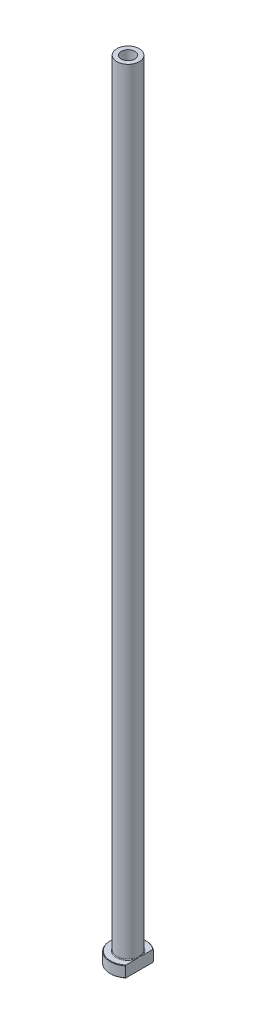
ISO-10303-21;
HEADER;
FILE_DESCRIPTION(('STEP AP214'),'2;1');
FILE_NAME('part.step','',(''),(''),'','','');
FILE_SCHEMA(('AUTOMOTIVE_DESIGN { 1 0 10303 214 1 1 1 1 }'));
ENDSEC;
DATA;
#1=APPLICATION_CONTEXT('core data for automotive mechanical design processes');
#2=APPLICATION_PROTOCOL_DEFINITION('international standard','automotive_design',2000,#1);
#3=PRODUCT_CONTEXT('',#1,'mechanical');
#4=PRODUCT('Part','Part','',(#3));
#5=PRODUCT_RELATED_PRODUCT_CATEGORY('part','',(#4));
#6=PRODUCT_DEFINITION_FORMATION('','',#4);
#7=PRODUCT_DEFINITION_CONTEXT('part definition',#1,'design');
#8=PRODUCT_DEFINITION('design','',#6,#7);
#9=PRODUCT_DEFINITION_SHAPE('','',#8);
#10=(LENGTH_UNIT() NAMED_UNIT(*) SI_UNIT(.MILLI.,.METRE.));
#11=(NAMED_UNIT(*) PLANE_ANGLE_UNIT() SI_UNIT($,.RADIAN.));
#12=(NAMED_UNIT(*) SI_UNIT($,.STERADIAN.) SOLID_ANGLE_UNIT());
#13=UNCERTAINTY_MEASURE_WITH_UNIT(LENGTH_MEASURE(1.E-05),#10,'distance_accuracy_value','');
#14=(GEOMETRIC_REPRESENTATION_CONTEXT(3) GLOBAL_UNCERTAINTY_ASSIGNED_CONTEXT((#13)) GLOBAL_UNIT_ASSIGNED_CONTEXT((#10,
#11,#12)) REPRESENTATION_CONTEXT('',''));
#15=CARTESIAN_POINT('',(0.,0.,0.));
#16=DIRECTION('',(0.,0.,1.));
#17=DIRECTION('',(1.,0.,0.));
#18=AXIS2_PLACEMENT_3D('',#15,#16,#17);
#19=CARTESIAN_POINT('',(0.,92.1876809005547,0.));
#20=DIRECTION('',(0.,1.,0.));
#21=DIRECTION('',(0.,0.,1.));
#22=AXIS2_PLACEMENT_3D('',#19,#20,#21);
#23=CYLINDRICAL_SURFACE('',#22,3.00000000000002);
#24=CARTESIAN_POINT('',(0.,350.,0.));
#25=DIRECTION('',(0.,1.,0.));
#26=DIRECTION('',(0.,0.,1.));
#27=AXIS2_PLACEMENT_3D('',#24,#25,#26);
#28=CIRCLE('',#27,3.00000000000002);
#29=CARTESIAN_POINT('',(0.,350.,3.00000000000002));
#30=VERTEX_POINT('',#29);
#31=EDGE_CURVE('E167',#30,#30,#28,.T.);
#32=ORIENTED_EDGE('',*,*,#31,.T.);
#33=EDGE_LOOP('',(#32));
#34=FACE_BOUND('',#33,.T.);
#35=CARTESIAN_POINT('',(0.,305.,0.));
#36=DIRECTION('',(0.,1.,0.));
#37=DIRECTION('',(0.,0.,1.));
#38=AXIS2_PLACEMENT_3D('',#35,#36,#37);
#39=CIRCLE('',#38,3.00000000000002);
#40=CARTESIAN_POINT('',(0.,305.,3.00000000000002));
#41=VERTEX_POINT('',#40);
#42=EDGE_CURVE('E170',#41,#41,#39,.T.);
#43=ORIENTED_EDGE('',*,*,#42,.F.);
#44=EDGE_LOOP('',(#43));
#45=FACE_BOUND('',#44,.T.);
#46=ADVANCED_FACE('F32',(#34,#45),#23,.F.);
#47=CARTESIAN_POINT('',(-3.00000000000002,350.,0.));
#48=DIRECTION('',(0.,1.,0.));
#49=DIRECTION('',(0.,0.,1.));
#50=AXIS2_PLACEMENT_3D('',#47,#48,#49);
#51=PLANE('',#50);
#52=CARTESIAN_POINT('',(0.,350.,0.));
#53=DIRECTION('',(0.,1.,0.));
#54=DIRECTION('',(0.,0.,1.));
#55=AXIS2_PLACEMENT_3D('',#52,#53,#54);
#56=CIRCLE('',#55,5.00000000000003);
#57=CARTESIAN_POINT('',(0.,350.,5.00000000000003));
#58=VERTEX_POINT('',#57);
#59=EDGE_CURVE('E174',#58,#58,#56,.T.);
#60=ORIENTED_EDGE('',*,*,#59,.T.);
#61=EDGE_LOOP('',(#60));
#62=FACE_BOUND('',#61,.T.);
#63=ORIENTED_EDGE('',*,*,#31,.F.);
#64=EDGE_LOOP('',(#63));
#65=FACE_BOUND('',#64,.T.);
#66=ADVANCED_FACE('F157',(#62,#65),#51,.T.);
#67=CARTESIAN_POINT('',(0.,92.1876809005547,0.));
#68=DIRECTION('',(0.,1.,0.));
#69=DIRECTION('',(0.,0.,1.));
#70=AXIS2_PLACEMENT_3D('',#67,#68,#69);
#71=CYLINDRICAL_SURFACE('',#70,5.00000000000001);
#72=CARTESIAN_POINT('',(0.,5.3,0.));
#73=DIRECTION('',(0.,1.,0.));
#74=DIRECTION('',(0.,0.,1.));
#75=AXIS2_PLACEMENT_3D('',#72,#73,#74);
#76=CIRCLE('',#75,5.00000000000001);
#77=CARTESIAN_POINT('',(5.,5.3,0.));
#78=VERTEX_POINT('',#77);
#79=EDGE_CURVE('E180',#78,#78,#76,.T.);
#80=ORIENTED_EDGE('',*,*,#79,.T.);
#81=EDGE_LOOP('',(#80));
#82=FACE_BOUND('',#81,.T.);
#83=ORIENTED_EDGE('',*,*,#59,.F.);
#84=EDGE_LOOP('',(#83));
#85=FACE_BOUND('',#84,.T.);
#86=ADVANCED_FACE('F162',(#82,#85),#71,.T.);
#87=CARTESIAN_POINT('',(-4.99999999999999,5.,0.));
#88=DIRECTION('',(0.,1.,0.));
#89=DIRECTION('',(0.,0.,1.));
#90=AXIS2_PLACEMENT_3D('',#87,#88,#89);
#91=PLANE('',#90);
#92=DIRECTION('',(0.,0.,1.));
#93=VECTOR('',#92,1.);
#94=CARTESIAN_POINT('',(5.,5.,0.));
#95=LINE('',#94,#93);
#96=CARTESIAN_POINT('',(5.,5.,-5.98665181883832));
#97=VERTEX_POINT('',#96);
#98=CARTESIAN_POINT('',(5.,5.,-1.75783958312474));
#99=VERTEX_POINT('',#98);
#100=EDGE_CURVE('E54',#97,#99,#95,.T.);
#101=ORIENTED_EDGE('',*,*,#100,.F.);
#102=CARTESIAN_POINT('',(0.,5.,0.));
#103=DIRECTION('',(0.,1.,0.));
#104=DIRECTION('',(0.,0.,1.));
#105=AXIS2_PLACEMENT_3D('',#102,#103,#104);
#106=CIRCLE('',#105,7.80000000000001);
#107=CARTESIAN_POINT('',(4.99999999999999,5.,5.98665181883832));
#108=VERTEX_POINT('',#107);
#109=EDGE_CURVE('E186',#97,#108,#106,.T.);
#110=ORIENTED_EDGE('',*,*,#109,.T.);
#111=CARTESIAN_POINT('',(5.,5.,1.75783958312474));
#112=VERTEX_POINT('',#111);
#113=EDGE_CURVE('E134',#112,#108,#95,.T.);
#114=ORIENTED_EDGE('',*,*,#113,.F.);
#115=CARTESIAN_POINT('',(0.,5.,0.));
#116=DIRECTION('',(0.,1.,0.));
#117=DIRECTION('',(0.,0.,1.));
#118=AXIS2_PLACEMENT_3D('',#115,#116,#117);
#119=CIRCLE('',#118,5.30000000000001);
#120=EDGE_CURVE('E183',#112,#99,#119,.F.);
#121=ORIENTED_EDGE('',*,*,#120,.T.);
#122=EDGE_LOOP('',(#101,#110,#114,#121));
#123=FACE_BOUND('',#122,.T.);
#124=ADVANCED_FACE('F197',(#123),#91,.T.);
#125=CARTESIAN_POINT('',(0.,92.1876809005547,0.));
#126=DIRECTION('',(0.,1.,0.));
#127=DIRECTION('',(0.,0.,1.));
#128=AXIS2_PLACEMENT_3D('',#125,#126,#127);
#129=CYLINDRICAL_SURFACE('',#128,7.99999999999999);
#130=DIRECTION('',(0.,-1.,0.));
#131=VECTOR('',#130,1.);
#132=CARTESIAN_POINT('',(4.99999999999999,350.,6.24499799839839));
#133=LINE('',#132,#131);
#134=CARTESIAN_POINT('',(4.99999999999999,4.80000000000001,6.24499799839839));
#135=VERTEX_POINT('',#134);
#136=CARTESIAN_POINT('',(4.99999999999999,0.20000000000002,6.24499799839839));
#137=VERTEX_POINT('',#136);
#138=EDGE_CURVE('E82',#135,#137,#133,.T.);
#139=ORIENTED_EDGE('',*,*,#138,.F.);
#140=CARTESIAN_POINT('',(0.,4.80000000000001,0.));
#141=DIRECTION('',(0.,1.,0.));
#142=DIRECTION('',(0.,0.,1.));
#143=AXIS2_PLACEMENT_3D('',#140,#141,#142);
#144=CIRCLE('',#143,7.99999999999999);
#145=CARTESIAN_POINT('',(5.,4.80000000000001,-6.24499799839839));
#146=VERTEX_POINT('',#145);
#147=EDGE_CURVE('E95',#135,#146,#144,.F.);
#148=ORIENTED_EDGE('',*,*,#147,.T.);
#149=DIRECTION('',(0.,-1.,0.));
#150=VECTOR('',#149,1.);
#151=CARTESIAN_POINT('',(5.,350.,-6.24499799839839));
#152=LINE('',#151,#150);
#153=CARTESIAN_POINT('',(5.,0.20000000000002,-6.24499799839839));
#154=VERTEX_POINT('',#153);
#155=EDGE_CURVE('E192',#146,#154,#152,.T.);
#156=ORIENTED_EDGE('',*,*,#155,.T.);
#157=CARTESIAN_POINT('',(0.,0.20000000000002,0.));
#158=DIRECTION('',(0.,-1.,0.));
#159=DIRECTION('',(0.,0.,-1.));
#160=AXIS2_PLACEMENT_3D('',#157,#158,#159);
#161=CIRCLE('',#160,7.99999999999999);
#162=EDGE_CURVE('E98',#154,#137,#161,.F.);
#163=ORIENTED_EDGE('',*,*,#162,.T.);
#164=EDGE_LOOP('',(#139,#148,#156,#163));
#165=FACE_BOUND('',#164,.T.);
#166=ADVANCED_FACE('F190',(#165),#129,.T.);
#167=CARTESIAN_POINT('',(-7.99999999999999,0.,0.));
#168=DIRECTION('',(0.,-1.,0.));
#169=DIRECTION('',(0.,0.,-1.));
#170=AXIS2_PLACEMENT_3D('',#167,#168,#169);
#171=PLANE('',#170);
#172=CARTESIAN_POINT('',(0.,0.,0.));
#173=DIRECTION('',(0.,-1.,0.));
#174=DIRECTION('',(0.,0.,-1.));
#175=AXIS2_PLACEMENT_3D('',#172,#173,#174);
#176=CIRCLE('',#175,3.74999999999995);
#177=CARTESIAN_POINT('',(0.,0.,-3.74999999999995));
#178=VERTEX_POINT('',#177);
#179=EDGE_CURVE('E40',#178,#178,#176,.F.);
#180=ORIENTED_EDGE('',*,*,#179,.T.);
#181=EDGE_LOOP('',(#180));
#182=FACE_BOUND('',#181,.T.);
#183=DIRECTION('',(0.,0.,-1.));
#184=VECTOR('',#183,1.);
#185=CARTESIAN_POINT('',(4.99999999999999,0.,6.24499799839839));
#186=LINE('',#185,#184);
#187=CARTESIAN_POINT('',(4.99999999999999,0.,5.98665181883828));
#188=VERTEX_POINT('',#187);
#189=CARTESIAN_POINT('',(5.,0.,-5.98665181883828));
#190=VERTEX_POINT('',#189);
#191=EDGE_CURVE('E47',#188,#190,#186,.T.);
#192=ORIENTED_EDGE('',*,*,#191,.F.);
#193=CARTESIAN_POINT('',(0.,0.,0.));
#194=DIRECTION('',(0.,-1.,0.));
#195=DIRECTION('',(0.,0.,-1.));
#196=AXIS2_PLACEMENT_3D('',#193,#194,#195);
#197=CIRCLE('',#196,7.79999999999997);
#198=EDGE_CURVE('E92',#188,#190,#197,.T.);
#199=ORIENTED_EDGE('',*,*,#198,.T.);
#200=EDGE_LOOP('',(#192,#199));
#201=FACE_BOUND('',#200,.T.);
#202=ADVANCED_FACE('F91',(#182,#201),#171,.T.);
#203=CARTESIAN_POINT('',(0.,92.1876809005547,0.));
#204=DIRECTION('',(0.,1.,0.));
#205=DIRECTION('',(0.,0.,1.));
#206=AXIS2_PLACEMENT_3D('',#203,#204,#205);
#207=CYLINDRICAL_SURFACE('',#206,3.25000000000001);
#208=CARTESIAN_POINT('',(0.,0.499999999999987,0.));
#209=DIRECTION('',(0.,-1.,0.));
#210=DIRECTION('',(0.,0.,-1.));
#211=AXIS2_PLACEMENT_3D('',#208,#209,#210);
#212=CIRCLE('',#211,3.25000000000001);
#213=CARTESIAN_POINT('',(0.,0.499999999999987,-3.25000000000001));
#214=VERTEX_POINT('',#213);
#215=EDGE_CURVE('E11',#214,#214,#212,.T.);
#216=ORIENTED_EDGE('',*,*,#215,.T.);
#217=EDGE_LOOP('',(#216));
#218=FACE_BOUND('',#217,.T.);
#219=CARTESIAN_POINT('',(0.,293.,0.));
#220=DIRECTION('',(0.,1.,0.));
#221=DIRECTION('',(0.,0.,1.));
#222=AXIS2_PLACEMENT_3D('',#219,#220,#221);
#223=CIRCLE('',#222,3.25000000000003);
#224=CARTESIAN_POINT('',(0.,293.,3.25000000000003));
#225=VERTEX_POINT('',#224);
#226=EDGE_CURVE('E172',#225,#225,#223,.T.);
#227=ORIENTED_EDGE('',*,*,#226,.T.);
#228=EDGE_LOOP('',(#227));
#229=FACE_BOUND('',#228,.T.);
#230=ADVANCED_FACE('F215',(#218,#229),#207,.F.);
#231=CARTESIAN_POINT('',(0.,293.,0.));
#232=DIRECTION('',(0.,-1.,0.));
#233=DIRECTION('',(0.,0.,-1.));
#234=AXIS2_PLACEMENT_3D('',#231,#232,#233);
#235=CONICAL_SURFACE('',#234,3.25000000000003,0.0208303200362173);
#236=ORIENTED_EDGE('',*,*,#42,.T.);
#237=EDGE_LOOP('',(#236));
#238=FACE_BOUND('',#237,.T.);
#239=ORIENTED_EDGE('',*,*,#226,.F.);
#240=EDGE_LOOP('',(#239));
#241=FACE_BOUND('',#240,.T.);
#242=ADVANCED_FACE('F111',(#238,#241),#235,.F.);
#243=CARTESIAN_POINT('',(0.,5.3,0.));
#244=DIRECTION('',(0.,1.,0.));
#245=DIRECTION('',(0.,0.,1.));
#246=AXIS2_PLACEMENT_3D('',#243,#244,#245);
#247=TOROIDAL_SURFACE('',#246,5.30000000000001,0.3);
#248=ORIENTED_EDGE('',*,*,#120,.F.);
#249=CARTESIAN_POINT('',(5.,5.3,0.));
#250=CARTESIAN_POINT('',(5.,5.3000006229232,-1.3146900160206E-10));
#251=CARTESIAN_POINT('',(5.,5.30000124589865,2.5275949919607E-07));
#252=CARTESIAN_POINT('',(5.,5.30000240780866,9.47164923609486E-07));
#253=CARTESIAN_POINT('',(5.,5.30000293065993,1.40594102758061E-06));
#254=CARTESIAN_POINT('',(5.,5.30000402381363,2.50637697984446E-06));
#255=CARTESIAN_POINT('',(5.,5.30000457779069,3.16589020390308E-06));
#256=CARTESIAN_POINT('',(5.,5.30000556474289,4.52860090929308E-06));
#257=CARTESIAN_POINT('',(5.,5.30000600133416,5.22939564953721E-06));
#258=CARTESIAN_POINT('',(5.,5.30000763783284,7.96122182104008E-06));
#259=CARTESIAN_POINT('',(5.,5.30000875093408,1.00477434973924E-05));
#260=CARTESIAN_POINT('',(5.,5.30001056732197,1.41660902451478E-05));
#261=CARTESIAN_POINT('',(5.,5.30001129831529,1.61861809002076E-05));
#262=CARTESIAN_POINT('',(5.,5.30001439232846,2.47865783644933E-05));
#263=CARTESIAN_POINT('',(5.,5.3000167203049,3.13830342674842E-05));
#264=CARTESIAN_POINT('',(5.,5.30002012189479,4.38084288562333E-05));
#265=CARTESIAN_POINT('',(5.,5.30002133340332,4.95992799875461E-05));
#266=CARTESIAN_POINT('',(5.,5.30003020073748,9.27862708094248E-05));
#267=CARTESIAN_POINT('',(5.,5.30003696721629,0.000130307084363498));
#268=CARTESIAN_POINT('',(4.99999999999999,5.30006659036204,0.000278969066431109));
#269=CARTESIAN_POINT('',(4.99999999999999,5.30009481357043,0.000389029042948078));
#270=CARTESIAN_POINT('',(5.,5.30020506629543,0.000826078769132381));
#271=CARTESIAN_POINT('',(5.,5.30028365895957,0.00115365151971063));
#272=CARTESIAN_POINT('',(4.99999999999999,5.30059919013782,0.00245925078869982));
#273=CARTESIAN_POINT('',(4.99999999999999,5.30084048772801,0.00343651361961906));
#274=CARTESIAN_POINT('',(5.,5.30184626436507,0.00752058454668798));
#275=CARTESIAN_POINT('',(5.,5.30260525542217,0.0106283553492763));
#276=CARTESIAN_POINT('',(4.99999999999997,5.30996461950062,0.0407482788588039));
#277=CARTESIAN_POINT('',(4.99999999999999,5.31658985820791,0.0677561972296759));
#278=CARTESIAN_POINT('',(5.,5.32953319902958,0.120688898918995));
#279=CARTESIAN_POINT('',(5.,5.33585289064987,0.146613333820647));
#280=CARTESIAN_POINT('',(4.99999999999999,5.34926050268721,0.201795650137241));
#281=CARTESIAN_POINT('',(4.99999999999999,5.35634306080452,0.231054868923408));
#282=CARTESIAN_POINT('',(5.,5.370502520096,0.289917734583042));
#283=CARTESIAN_POINT('',(5.,5.37757848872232,0.319521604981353));
#284=CARTESIAN_POINT('',(5.,5.39452602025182,0.391032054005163));
#285=CARTESIAN_POINT('',(5.,5.40434071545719,0.432952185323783));
#286=CARTESIAN_POINT('',(5.,5.42340141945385,0.515763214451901));
#287=CARTESIAN_POINT('',(5.,5.43265559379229,0.556652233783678));
#288=CARTESIAN_POINT('',(5.,5.45710553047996,0.667075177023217));
#289=CARTESIAN_POINT('',(5.,5.47194176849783,0.736689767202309));
#290=CARTESIAN_POINT('',(5.,5.50018229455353,0.87683662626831));
#291=CARTESIAN_POINT('',(5.,5.51357312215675,0.947371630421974));
#292=CARTESIAN_POINT('',(5.,5.53930921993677,1.09497328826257));
#293=CARTESIAN_POINT('',(5.,5.55146217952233,1.17207432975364));
#294=CARTESIAN_POINT('',(5.,5.57239669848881,1.32672649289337));
#295=CARTESIAN_POINT('',(5.,5.58117877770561,1.40427754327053));
#296=CARTESIAN_POINT('',(5.,5.59499725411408,1.5687382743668));
#297=CARTESIAN_POINT('',(5.,5.59948802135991,1.6557004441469));
#298=CARTESIAN_POINT('',(5.,5.60018885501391,1.78535304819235));
#299=CARTESIAN_POINT('',(5.,5.59945214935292,1.82802575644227));
#300=CARTESIAN_POINT('',(5.,5.59559364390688,1.9132508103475));
#301=CARTESIAN_POINT('',(5.,5.59247319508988,1.95580321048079));
#302=CARTESIAN_POINT('',(5.,5.58383242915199,2.03512365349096));
#303=CARTESIAN_POINT('',(5.,5.57867386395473,2.07192937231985));
#304=CARTESIAN_POINT('',(5.,5.56543793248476,2.14526756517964));
#305=CARTESIAN_POINT('',(5.,5.55734203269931,2.18179676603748));
#306=CARTESIAN_POINT('',(5.,5.53718005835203,2.25427226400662));
#307=CARTESIAN_POINT('',(5.,5.52507057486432,2.29020746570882));
#308=CARTESIAN_POINT('',(5.,5.50270928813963,2.34223029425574));
#309=CARTESIAN_POINT('',(5.,5.49457811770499,2.35922314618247));
#310=CARTESIAN_POINT('',(5.,5.47657809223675,2.39224900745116));
#311=CARTESIAN_POINT('',(5.,5.4667128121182,2.40828390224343));
#312=CARTESIAN_POINT('',(5.,5.44695893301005,2.43579467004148));
#313=CARTESIAN_POINT('',(5.,5.43745879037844,2.44754592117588));
#314=CARTESIAN_POINT('',(5.,5.41677914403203,2.4694647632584));
#315=CARTESIAN_POINT('',(5.,5.40560543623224,2.47963758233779));
#316=CARTESIAN_POINT('',(5.,5.38617750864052,2.49393642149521));
#317=CARTESIAN_POINT('',(5.,5.37851643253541,2.49886271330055));
#318=CARTESIAN_POINT('',(5.,5.36252740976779,2.50749953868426));
#319=CARTESIAN_POINT('',(5.,5.35419984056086,2.51121075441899));
#320=CARTESIAN_POINT('',(5.,5.3369064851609,2.51712941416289));
#321=CARTESIAN_POINT('',(5.,5.32793451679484,2.51931927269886));
#322=CARTESIAN_POINT('',(5.,5.30973576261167,2.52185978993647));
#323=CARTESIAN_POINT('',(5.,5.3005093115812,2.52221275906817));
#324=CARTESIAN_POINT('',(5.,5.28349166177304,2.52112455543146));
#325=CARTESIAN_POINT('',(5.,5.27568322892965,2.51993178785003));
#326=CARTESIAN_POINT('',(5.,5.26036860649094,2.51628294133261));
#327=CARTESIAN_POINT('',(5.,5.25286261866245,2.51382603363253));
#328=CARTESIAN_POINT('',(5.,5.23590266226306,2.5068548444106));
#329=CARTESIAN_POINT('',(5.,5.22661875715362,2.50192984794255));
#330=CARTESIAN_POINT('',(5.,5.20895514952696,2.49066548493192));
#331=CARTESIAN_POINT('',(5.,5.20057756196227,2.48432291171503));
#332=CARTESIAN_POINT('',(5.,5.17987008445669,2.4664521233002));
#333=CARTESIAN_POINT('',(5.,5.16824151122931,2.45411867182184));
#334=CARTESIAN_POINT('',(5.,5.14692461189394,2.42790849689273));
#335=CARTESIAN_POINT('',(5.,5.13723987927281,2.41402898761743));
#336=CARTESIAN_POINT('',(5.,5.11080706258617,2.37143175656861));
#337=CARTESIAN_POINT('',(5.,5.09628770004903,2.34134703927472));
#338=CARTESIAN_POINT('',(5.,5.07130349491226,2.27940731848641));
#339=CARTESIAN_POINT('',(5.,5.06087110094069,2.24754035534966));
#340=CARTESIAN_POINT('',(5.,5.03890359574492,2.16787245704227));
#341=CARTESIAN_POINT('',(5.,5.02913523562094,2.11959065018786));
#342=CARTESIAN_POINT('',(5.,5.0141695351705,2.02224928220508));
#343=CARTESIAN_POINT('',(5.,5.00898637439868,1.97318778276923));
#344=CARTESIAN_POINT('',(5.,5.00220823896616,1.87635767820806));
#345=CARTESIAN_POINT('',(5.,5.00050709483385,1.82859609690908));
#346=CARTESIAN_POINT('',(5.,4.99969104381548,1.73330165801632));
#347=CARTESIAN_POINT('',(5.,5.00056327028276,1.68576884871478));
#348=CARTESIAN_POINT('',(5.,5.00484296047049,1.57937770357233));
#349=CARTESIAN_POINT('',(5.,5.00880932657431,1.52054285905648));
#350=CARTESIAN_POINT('',(5.,5.01925964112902,1.40312974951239));
#351=CARTESIAN_POINT('',(5.,5.02574264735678,1.34455139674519));
#352=CARTESIAN_POINT('',(5.,5.04090087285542,1.22627662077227));
#353=CARTESIAN_POINT('',(5.,5.04962425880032,1.16658647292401));
#354=CARTESIAN_POINT('',(5.,5.06877923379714,1.04732463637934));
#355=CARTESIAN_POINT('',(5.,5.07921523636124,0.987753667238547));
#356=CARTESIAN_POINT('',(5.,5.10551698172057,0.84693616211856));
#357=CARTESIAN_POINT('',(5.,5.12196565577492,0.765799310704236));
#358=CARTESIAN_POINT('',(5.,5.15639716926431,0.604819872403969));
#359=CARTESIAN_POINT('',(4.99999999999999,5.17436050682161,0.524973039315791));
#360=CARTESIAN_POINT('',(5.,5.20921667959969,0.37472665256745));
#361=CARTESIAN_POINT('',(5.,5.22599388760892,0.304300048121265));
#362=CARTESIAN_POINT('',(4.99999999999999,5.25191105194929,0.196907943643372));
#363=CARTESIAN_POINT('',(4.99999999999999,5.26090146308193,0.159905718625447));
#364=CARTESIAN_POINT('',(5.,5.27881854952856,0.0865164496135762));
#365=CARTESIAN_POINT('',(5.00000000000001,5.2877439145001,0.050129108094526));
#366=CARTESIAN_POINT('',(4.99999999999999,5.29739627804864,0.0106218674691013));
#367=CARTESIAN_POINT('',(4.99999999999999,5.29815688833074,0.00750762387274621));
#368=CARTESIAN_POINT('',(5.,5.29916304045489,0.00342209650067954));
#369=CARTESIAN_POINT('',(5.,5.29940309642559,0.00244985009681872));
#370=CARTESIAN_POINT('',(4.99999999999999,5.29971711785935,0.00115049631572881));
#371=CARTESIAN_POINT('',(4.99999999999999,5.29979541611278,0.000824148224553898));
#372=CARTESIAN_POINT('',(5.,5.29990531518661,0.00038852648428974));
#373=CARTESIAN_POINT('',(5.,5.29993348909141,0.000278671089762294));
#374=CARTESIAN_POINT('',(5.,5.29996306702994,0.000130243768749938));
#375=CARTESIAN_POINT('',(4.99999999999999,5.29996982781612,9.27511472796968E-05));
#376=CARTESIAN_POINT('',(5.,5.29997868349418,4.95929950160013E-05));
#377=CARTESIAN_POINT('',(5.,5.29997989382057,4.38036623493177E-05));
#378=CARTESIAN_POINT('',(5.,5.29998329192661,3.13814244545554E-05));
#379=CARTESIAN_POINT('',(5.,5.29998561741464,2.47865262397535E-05));
#380=CARTESIAN_POINT('',(5.,5.29998870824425,1.61877572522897E-05));
#381=CARTESIAN_POINT('',(5.,5.29998943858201,1.41677797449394E-05));
#382=CARTESIAN_POINT('',(5.,5.29999125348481,1.00495556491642E-05));
#383=CARTESIAN_POINT('',(5.,5.29999236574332,7.9630285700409E-06));
#384=CARTESIAN_POINT('',(5.,5.29999400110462,5.23107535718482E-06));
#385=CARTESIAN_POINT('',(5.,5.29999443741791,4.53021160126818E-06));
#386=CARTESIAN_POINT('',(5.,5.29999542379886,3.1673126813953E-06));
#387=CARTESIAN_POINT('',(5.,5.29999597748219,2.50767819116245E-06));
#388=CARTESIAN_POINT('',(5.,5.29999707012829,1.40695944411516E-06));
#389=CARTESIAN_POINT('',(5.,5.29999759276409,9.48033029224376E-07));
#390=CARTESIAN_POINT('',(5.,5.29999875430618,2.53244607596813E-07));
#391=CARTESIAN_POINT('',(5.,5.29999937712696,1.31459803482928E-10));
#392=CARTESIAN_POINT('',(5.,5.3,0.));
#393=B_SPLINE_CURVE_WITH_KNOTS('',3,(#249,#250,#251,#252,#253,#254,#255,#256,#257,#258,#259,
#260,#261,#262,#263,#264,#265,#266,#267,#268,#269,#270,#271,#272,#273,#274,#275,#276,#277,#278,
#279,#280,#281,#282,#283,#284,#285,#286,#287,#288,#289,#290,#291,#292,#293,#294,#295,#296,#297,
#298,#299,#300,#301,#302,#303,#304,#305,#306,#307,#308,#309,#310,#311,#312,#313,#314,#315,#316,
#317,#318,#319,#320,#321,#322,#323,#324,#325,#326,#327,#328,#329,#330,#331,#332,#333,#334,#335,
#336,#337,#338,#339,#340,#341,#342,#343,#344,#345,#346,#347,#348,#349,#350,#351,#352,#353,#354,
#355,#356,#357,#358,#359,#360,#361,#362,#363,#364,#365,#366,#367,#368,#369,#370,#371,#372,#373,
#374,#375,#376,#377,#378,#379,#380,#381,#382,#383,#384,#385,#386,#387,#388,#389,#390,#391,#392),
.UNSPECIFIED.,.T.,.F.,(4,2,2,2,2,2,2,2,2,2,2,2,2,2,2,2,2,2,2,2,2,2,2,2,2,2,2,2,2,2,2,2,2,2,2,2,
2,2,2,2,2,2,2,2,2,2,2,2,2,2,2,2,2,2,2,2,2,2,2,2,2,2,2,2,2,2,2,2,2,2,2,4),(0.,
1.88938973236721E-06,3.98058305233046E-06,6.54817790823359E-06,9.02403411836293E-06,
1.60938640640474E-05,2.25328058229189E-05,4.34843790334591E-05,6.12120027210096E-05,
0.000175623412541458,0.000516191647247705,0.00152710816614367,0.00454656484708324,
0.0141443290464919,0.0975679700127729,0.177619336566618,0.267931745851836,0.35924502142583,
0.4884051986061,0.614173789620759,0.827694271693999,1.04305715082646,1.27715608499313,
1.51121890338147,1.77214751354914,1.90013509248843,2.028050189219,2.13945459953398,
2.25157451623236,2.36494894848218,2.42139235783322,2.4777207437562,2.5229380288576,
2.5680021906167,2.59524342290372,2.62246933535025,2.65000494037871,2.67750590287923,
2.70108948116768,2.72468854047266,2.75603978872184,2.78746268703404,2.8380280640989,
2.8886860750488,2.98834295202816,3.08877575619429,3.23618650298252,3.38405153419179,
3.52733651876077,3.66990630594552,3.84673903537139,4.02350562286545,4.20444776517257,
4.38586374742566,4.63419556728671,4.87971270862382,5.09690175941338,5.21113882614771,
5.32353360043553,5.33315137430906,5.33615533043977,5.33716246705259,5.33750240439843,
5.33761672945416,5.33763445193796,5.33765539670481,5.33766183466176,5.33766890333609,
5.33767137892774,5.33767394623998,5.33767603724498,5.33767792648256),.UNSPECIFIED.);
#394=EDGE_CURVE('E126',#112,#78,#393,.T.);
#395=ORIENTED_EDGE('',*,*,#394,.T.);
#396=ORIENTED_EDGE('',*,*,#79,.F.);
#397=CARTESIAN_POINT('',(5.,5.3,0.));
#398=CARTESIAN_POINT('',(5.,5.2999993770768,1.31470615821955E-10));
#399=CARTESIAN_POINT('',(5.,5.29999875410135,-2.52759497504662E-07));
#400=CARTESIAN_POINT('',(5.,5.29999759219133,-9.47164922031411E-07));
#401=CARTESIAN_POINT('',(5.,5.29999706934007,-1.40594102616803E-06));
#402=CARTESIAN_POINT('',(5.,5.29999597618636,-2.50637697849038E-06));
#403=CARTESIAN_POINT('',(5.,5.29999542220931,-3.16589020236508E-06));
#404=CARTESIAN_POINT('',(5.,5.2999944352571,-4.52860090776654E-06));
#405=CARTESIAN_POINT('',(5.,5.29999399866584,-5.2293956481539E-06));
#406=CARTESIAN_POINT('',(5.,5.29999236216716,-7.96122182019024E-06));
#407=CARTESIAN_POINT('',(5.,5.29999124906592,-1.00477434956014E-05));
#408=CARTESIAN_POINT('',(5.,5.29998943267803,-1.41660902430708E-05));
#409=CARTESIAN_POINT('',(5.,5.29998870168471,-1.61861808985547E-05));
#410=CARTESIAN_POINT('',(5.,5.29998560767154,-2.47865783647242E-05));
#411=CARTESIAN_POINT('',(5.,5.2999832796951,-3.1383034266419E-05));
#412=CARTESIAN_POINT('',(5.,5.29997987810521,-4.38084288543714E-05));
#413=CARTESIAN_POINT('',(5.,5.29997866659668,-4.9599279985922E-05));
#414=CARTESIAN_POINT('',(5.,5.29996979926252,-9.2786270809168E-05));
#415=CARTESIAN_POINT('',(5.,5.2999630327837,-0.000130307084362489));
#416=CARTESIAN_POINT('',(4.99999999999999,5.29993340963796,-0.000278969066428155));
#417=CARTESIAN_POINT('',(4.99999999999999,5.29990518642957,-0.000389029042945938));
#418=CARTESIAN_POINT('',(5.,5.29979493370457,-0.000826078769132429));
#419=CARTESIAN_POINT('',(5.,5.29971634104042,-0.00115365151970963));
#420=CARTESIAN_POINT('',(4.99999999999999,5.29940080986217,-0.00245925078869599));
#421=CARTESIAN_POINT('',(4.99999999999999,5.29915951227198,-0.00343651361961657));
#422=CARTESIAN_POINT('',(5.00000000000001,5.29815373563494,-0.00752058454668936));
#423=CARTESIAN_POINT('',(5.,5.29739474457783,-0.0106283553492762));
#424=CARTESIAN_POINT('',(4.99999999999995,5.29003538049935,-0.0407482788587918));
#425=CARTESIAN_POINT('',(4.99999999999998,5.28341014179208,-0.0677561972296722));
#426=CARTESIAN_POINT('',(5.00000000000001,5.27046680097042,-0.120688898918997));
#427=CARTESIAN_POINT('',(5.,5.26414710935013,-0.146613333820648));
#428=CARTESIAN_POINT('',(4.99999999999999,5.25073949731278,-0.20179565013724));
#429=CARTESIAN_POINT('',(4.99999999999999,5.24365693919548,-0.231054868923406));
#430=CARTESIAN_POINT('',(5.,5.229497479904,-0.289917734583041));
#431=CARTESIAN_POINT('',(5.,5.22242151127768,-0.319521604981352));
#432=CARTESIAN_POINT('',(4.99999999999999,5.20547397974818,-0.391032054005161));
#433=CARTESIAN_POINT('',(5.,5.19565928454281,-0.432952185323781));
#434=CARTESIAN_POINT('',(5.,5.17659858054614,-0.515763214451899));
#435=CARTESIAN_POINT('',(5.,5.16734440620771,-0.556652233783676));
#436=CARTESIAN_POINT('',(5.,5.14289446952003,-0.667075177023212));
#437=CARTESIAN_POINT('',(5.,5.12805823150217,-0.736689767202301));
#438=CARTESIAN_POINT('',(5.,5.09981770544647,-0.876836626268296));
#439=CARTESIAN_POINT('',(5.,5.08642687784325,-0.947371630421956));
#440=CARTESIAN_POINT('',(5.,5.06069078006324,-1.09497328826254));
#441=CARTESIAN_POINT('',(5.,5.04853782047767,-1.17207432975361));
#442=CARTESIAN_POINT('',(5.,5.02760330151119,-1.32672649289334));
#443=CARTESIAN_POINT('',(5.,5.01882122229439,-1.40427754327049));
#444=CARTESIAN_POINT('',(5.,5.00500274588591,-1.56873827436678));
#445=CARTESIAN_POINT('',(5.,5.00051197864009,-1.6557004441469));
#446=CARTESIAN_POINT('',(5.,4.99981114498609,-1.78535304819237));
#447=CARTESIAN_POINT('',(5.,5.00054785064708,-1.82802575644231));
#448=CARTESIAN_POINT('',(5.,5.00440635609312,-1.91325081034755));
#449=CARTESIAN_POINT('',(5.,5.00752680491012,-1.95580321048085));
#450=CARTESIAN_POINT('',(5.,5.01616757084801,-2.035123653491));
#451=CARTESIAN_POINT('',(5.,5.02132613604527,-2.07192937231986));
#452=CARTESIAN_POINT('',(5.,5.03456206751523,-2.14526756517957));
#453=CARTESIAN_POINT('',(5.,5.04265796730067,-2.18179676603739));
#454=CARTESIAN_POINT('',(5.,5.06281994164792,-2.25427226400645));
#455=CARTESIAN_POINT('',(5.,5.07492942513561,-2.29020746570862));
#456=CARTESIAN_POINT('',(5.,5.09729071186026,-2.34223029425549));
#457=CARTESIAN_POINT('',(5.,5.10542188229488,-2.35922314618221));
#458=CARTESIAN_POINT('',(5.,5.12342190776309,-2.39224900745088));
#459=CARTESIAN_POINT('',(5.,5.13328718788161,-2.40828390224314));
#460=CARTESIAN_POINT('',(5.,5.15304106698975,-2.43579467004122));
#461=CARTESIAN_POINT('',(5.,5.16254120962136,-2.44754592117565));
#462=CARTESIAN_POINT('',(5.,5.18322085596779,-2.46946476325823));
#463=CARTESIAN_POINT('',(5.,5.19439456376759,-2.47963758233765));
#464=CARTESIAN_POINT('',(5.,5.21382249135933,-2.49393642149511));
#465=CARTESIAN_POINT('',(5.,5.22148356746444,-2.49886271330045));
#466=CARTESIAN_POINT('',(5.,5.23747259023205,-2.50749953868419));
#467=CARTESIAN_POINT('',(5.,5.24580015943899,-2.51121075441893));
#468=CARTESIAN_POINT('',(5.,5.26309351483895,-2.51712941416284));
#469=CARTESIAN_POINT('',(5.,5.27206548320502,-2.51931927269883));
#470=CARTESIAN_POINT('',(5.,5.29026423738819,-2.52185978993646));
#471=CARTESIAN_POINT('',(5.,5.29949068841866,-2.52221275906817));
#472=CARTESIAN_POINT('',(5.,5.31650833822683,-2.52112455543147));
#473=CARTESIAN_POINT('',(5.,5.32431677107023,-2.51993178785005));
#474=CARTESIAN_POINT('',(5.,5.33963139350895,-2.51628294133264));
#475=CARTESIAN_POINT('',(5.,5.34713738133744,-2.51382603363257));
#476=CARTESIAN_POINT('',(5.,5.36409733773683,-2.50685484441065));
#477=CARTESIAN_POINT('',(5.,5.37338124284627,-2.50192984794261));
#478=CARTESIAN_POINT('',(5.,5.39104485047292,-2.490665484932));
#479=CARTESIAN_POINT('',(5.,5.3994224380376,-2.48432291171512));
#480=CARTESIAN_POINT('',(5.,5.42012991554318,-2.46645212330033));
#481=CARTESIAN_POINT('',(5.,5.43175848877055,-2.45411867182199));
#482=CARTESIAN_POINT('',(5.,5.45307538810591,-2.42790849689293));
#483=CARTESIAN_POINT('',(5.,5.46276012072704,-2.41402898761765));
#484=CARTESIAN_POINT('',(5.,5.48919293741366,-2.37143175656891));
#485=CARTESIAN_POINT('',(5.,5.5037122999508,-2.34134703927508));
#486=CARTESIAN_POINT('',(5.,5.52869650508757,-2.27940731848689));
#487=CARTESIAN_POINT('',(5.,5.53912889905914,-2.24754035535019));
#488=CARTESIAN_POINT('',(5.,5.56109640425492,-2.16787245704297));
#489=CARTESIAN_POINT('',(5.,5.5708647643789,-2.11959065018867));
#490=CARTESIAN_POINT('',(5.,5.58583046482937,-2.02224928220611));
#491=CARTESIAN_POINT('',(5.,5.59101362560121,-1.97318778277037));
#492=CARTESIAN_POINT('',(5.,5.59779176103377,-1.87635767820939));
#493=CARTESIAN_POINT('',(5.,5.5994929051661,-1.82859609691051));
#494=CARTESIAN_POINT('',(5.,5.60030895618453,-1.73330165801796));
#495=CARTESIAN_POINT('',(5.,5.59943672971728,-1.68576884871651));
#496=CARTESIAN_POINT('',(5.,5.59515703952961,-1.57937770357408));
#497=CARTESIAN_POINT('',(5.,5.59119067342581,-1.52054285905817));
#498=CARTESIAN_POINT('',(5.,5.58074035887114,-1.40312974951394));
#499=CARTESIAN_POINT('',(5.,5.57425735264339,-1.34455139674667));
#500=CARTESIAN_POINT('',(5.,5.55909912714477,-1.22627662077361));
#501=CARTESIAN_POINT('',(5.,5.55037574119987,-1.16658647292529));
#502=CARTESIAN_POINT('',(5.,5.53122076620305,-1.04732463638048));
#503=CARTESIAN_POINT('',(5.,5.52078476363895,-0.987753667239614));
#504=CARTESIAN_POINT('',(5.,5.49448301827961,-0.846936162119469));
#505=CARTESIAN_POINT('',(4.99999999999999,5.47803434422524,-0.765799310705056));
#506=CARTESIAN_POINT('',(5.,5.44360283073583,-0.604819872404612));
#507=CARTESIAN_POINT('',(5.,5.42563949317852,-0.524973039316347));
#508=CARTESIAN_POINT('',(4.99999999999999,5.3907833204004,-0.374726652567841));
#509=CARTESIAN_POINT('',(4.99999999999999,5.37400611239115,-0.304300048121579));
#510=CARTESIAN_POINT('',(5.,5.34808894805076,-0.196907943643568));
#511=CARTESIAN_POINT('',(5.00000000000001,5.33909853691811,-0.159905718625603));
#512=CARTESIAN_POINT('',(4.99999999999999,5.32118145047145,-0.0865164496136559));
#513=CARTESIAN_POINT('',(4.99999999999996,5.31225608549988,-0.0501291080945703));
#514=CARTESIAN_POINT('',(5.,5.30260372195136,-0.0106218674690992));
#515=CARTESIAN_POINT('',(5.,5.30184311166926,-0.00750762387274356));
#516=CARTESIAN_POINT('',(4.99999999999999,5.30083695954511,-0.00342209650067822));
#517=CARTESIAN_POINT('',(4.99999999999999,5.30059690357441,-0.00244985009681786));
#518=CARTESIAN_POINT('',(5.,5.30028288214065,-0.00115049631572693));
#519=CARTESIAN_POINT('',(5.,5.30020458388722,-0.000824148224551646));
#520=CARTESIAN_POINT('',(4.99999999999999,5.30009468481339,-0.000388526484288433));
#521=CARTESIAN_POINT('',(4.99999999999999,5.30006651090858,-0.00027867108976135));
#522=CARTESIAN_POINT('',(5.,5.30003693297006,-0.000130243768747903));
#523=CARTESIAN_POINT('',(5.,5.30003017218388,-9.2751147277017E-05));
#524=CARTESIAN_POINT('',(5.,5.30002131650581,-4.95929950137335E-05));
#525=CARTESIAN_POINT('',(5.,5.30002010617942,-4.38036623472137E-05));
#526=CARTESIAN_POINT('',(5.,5.30001670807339,-3.13814244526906E-05));
#527=CARTESIAN_POINT('',(5.,5.30001438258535,-2.4786526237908E-05));
#528=CARTESIAN_POINT('',(5.,5.30001129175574,-1.61877572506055E-05));
#529=CARTESIAN_POINT('',(5.,5.30001056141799,-1.41677797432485E-05));
#530=CARTESIAN_POINT('',(5.,5.30000874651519,-1.00495556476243E-05));
#531=CARTESIAN_POINT('',(5.,5.30000763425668,-7.9630285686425E-06));
#532=CARTESIAN_POINT('',(5.,5.30000599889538,-5.23107535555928E-06));
#533=CARTESIAN_POINT('',(5.,5.30000556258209,-4.53021159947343E-06));
#534=CARTESIAN_POINT('',(5.,5.30000457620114,-3.16731267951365E-06));
#535=CARTESIAN_POINT('',(5.,5.30000402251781,-2.50767818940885E-06));
#536=CARTESIAN_POINT('',(5.,5.30000292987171,-1.40695944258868E-06));
#537=CARTESIAN_POINT('',(5.,5.30000240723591,-9.48033027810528E-07));
#538=CARTESIAN_POINT('',(5.,5.30000124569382,-2.53244606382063E-07));
#539=CARTESIAN_POINT('',(5.,5.30000062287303,-1.31458639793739E-10));
#540=CARTESIAN_POINT('',(5.,5.3,0.));
#541=B_SPLINE_CURVE_WITH_KNOTS('',3,(#397,#398,#399,#400,#401,#402,#403,#404,#405,#406,#407,
#408,#409,#410,#411,#412,#413,#414,#415,#416,#417,#418,#419,#420,#421,#422,#423,#424,#425,#426,
#427,#428,#429,#430,#431,#432,#433,#434,#435,#436,#437,#438,#439,#440,#441,#442,#443,#444,#445,
#446,#447,#448,#449,#450,#451,#452,#453,#454,#455,#456,#457,#458,#459,#460,#461,#462,#463,#464,
#465,#466,#467,#468,#469,#470,#471,#472,#473,#474,#475,#476,#477,#478,#479,#480,#481,#482,#483,
#484,#485,#486,#487,#488,#489,#490,#491,#492,#493,#494,#495,#496,#497,#498,#499,#500,#501,#502,
#503,#504,#505,#506,#507,#508,#509,#510,#511,#512,#513,#514,#515,#516,#517,#518,#519,#520,#521,
#522,#523,#524,#525,#526,#527,#528,#529,#530,#531,#532,#533,#534,#535,#536,#537,#538,#539,#540),
.UNSPECIFIED.,.T.,.F.,(4,2,2,2,2,2,2,2,2,2,2,2,2,2,2,2,2,2,2,2,2,2,2,2,2,2,2,2,2,2,2,2,2,2,2,2,
2,2,2,2,2,2,2,2,2,2,2,2,2,2,2,2,2,2,2,2,2,2,2,2,2,2,2,2,2,2,2,2,2,2,2,4),(0.,
1.8893897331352E-06,3.98058305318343E-06,6.54817790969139E-06,9.02403411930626E-06,
1.60938640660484E-05,2.25328058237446E-05,4.34843790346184E-05,6.12120027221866E-05,
0.000175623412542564,0.000516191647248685,0.00152710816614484,0.00454656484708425,
0.0141443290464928,0.097567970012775,0.17761933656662,0.267931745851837,0.35924502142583,
0.4884051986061,0.61417378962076,0.82769427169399,1.04305715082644,1.27715608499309,
1.51121890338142,1.77214751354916,1.90013509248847,2.02805018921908,2.13945459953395,
2.25157451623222,2.36494894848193,2.42139235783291,2.47772074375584,2.52293802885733,
2.56800219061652,2.59524342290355,2.6224693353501,2.65000494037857,2.6775059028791,
2.70108948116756,2.72468854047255,2.75603978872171,2.78746268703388,2.83802806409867,
2.88868607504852,2.98834295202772,3.08877575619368,3.23618650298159,3.38405153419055,
3.52733651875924,3.6699063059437,3.84673903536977,4.02350562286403,4.20444776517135,
4.38586374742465,4.63419556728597,4.87971270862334,5.09690175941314,5.21113882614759,
5.32353360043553,5.33315137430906,5.33615533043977,5.33716246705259,5.33750240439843,
5.33761672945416,5.33763445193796,5.33765539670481,5.33766183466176,5.33766890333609,
5.33767137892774,5.33767394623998,5.33767603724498,5.33767792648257),.UNSPECIFIED.);
#542=EDGE_CURVE('E135',#78,#99,#541,.T.);
#543=ORIENTED_EDGE('',*,*,#542,.T.);
#544=EDGE_LOOP('',(#248,#395,#396,#543));
#545=FACE_BOUND('',#544,.T.);
#546=ADVANCED_FACE('F141',(#545),#247,.F.);
#547=CARTESIAN_POINT('',(0.,5.,0.));
#548=DIRECTION('',(0.,-1.,0.));
#549=DIRECTION('',(0.,0.,-1.));
#550=AXIS2_PLACEMENT_3D('',#547,#548,#549);
#551=CONICAL_SURFACE('',#550,7.8,0.78539816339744);
#552=CARTESIAN_POINT('',(5.,-1.82162423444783,-13.7401563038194));
#553=CARTESIAN_POINT('',(5.,-1.61889813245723,-13.5244204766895));
#554=CARTESIAN_POINT('',(5.,-1.41646387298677,-13.3084101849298));
#555=CARTESIAN_POINT('',(5.,-1.01227657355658,-12.8757508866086));
#556=CARTESIAN_POINT('',(5.,-0.81052353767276,-12.6591018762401));
#557=CARTESIAN_POINT('',(5.,-0.206157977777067,-12.0077661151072));
#558=CARTESIAN_POINT('',(5.,0.195280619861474,-11.5719884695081));
#559=CARTESIAN_POINT('',(5.,1.00388282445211,-10.6856136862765));
#560=CARTESIAN_POINT('',(5.,1.41093902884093,-10.2349182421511));
#561=CARTESIAN_POINT('',(5.,2.01658324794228,-9.55471676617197));
#562=CARTESIAN_POINT('',(5.,2.21758236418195,-9.32735800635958));
#563=CARTESIAN_POINT('',(5.,2.61761142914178,-8.87091599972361));
#564=CARTESIAN_POINT('',(5.,2.81664139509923,-8.64183276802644));
#565=CARTESIAN_POINT('',(5.,3.21217345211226,-8.18170099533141));
#566=CARTESIAN_POINT('',(5.,3.40867681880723,-7.95065355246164));
#567=CARTESIAN_POINT('',(5.,3.79865427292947,-7.4859998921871));
#568=CARTESIAN_POINT('',(5.,3.99212827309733,-7.25239360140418));
#569=CARTESIAN_POINT('',(5.,4.37558160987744,-6.78155890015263));
#570=CARTESIAN_POINT('',(5.,4.56555334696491,-6.54432428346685));
#571=CARTESIAN_POINT('',(5.,4.94042138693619,-6.06589574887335));
#572=CARTESIAN_POINT('',(5.,5.12531810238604,-5.82470215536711));
#573=CARTESIAN_POINT('',(5.,5.48653546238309,-5.33972956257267));
#574=CARTESIAN_POINT('',(5.,5.6629239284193,-5.09600137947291));
#575=CARTESIAN_POINT('',(5.,6.00675382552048,-4.60213647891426));
#576=CARTESIAN_POINT('',(5.,6.17419169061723,-4.35199726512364));
#577=CARTESIAN_POINT('',(5.,6.49592993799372,-3.84445040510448));
#578=CARTESIAN_POINT('',(5.,6.65027272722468,-3.58707012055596));
#579=CARTESIAN_POINT('',(5.,6.86813414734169,-3.19356592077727));
#580=CARTESIAN_POINT('',(5.,6.93845533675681,-3.06120993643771));
#581=CARTESIAN_POINT('',(5.,7.07360441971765,-2.79373319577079));
#582=CARTESIAN_POINT('',(5.,7.13843319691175,-2.65861288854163));
#583=CARTESIAN_POINT('',(5.,7.26869642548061,-2.3693638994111));
#584=CARTESIAN_POINT('',(5.,7.33331212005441,-2.21486278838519));
#585=CARTESIAN_POINT('',(5.,7.45243473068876,-1.9019407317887));
#586=CARTESIAN_POINT('',(5.,7.50694001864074,-1.74351915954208));
#587=CARTESIAN_POINT('',(5.,7.60343746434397,-1.42384276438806));
#588=CARTESIAN_POINT('',(5.,7.64549910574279,-1.26260921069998));
#589=CARTESIAN_POINT('',(5.,7.71543089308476,-0.937062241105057));
#590=CARTESIAN_POINT('',(5.,7.74330266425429,-0.772749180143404));
#591=CARTESIAN_POINT('',(5.,7.78344284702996,-0.439876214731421));
#592=CARTESIAN_POINT('',(5.,7.79548961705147,-0.271289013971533));
#593=CARTESIAN_POINT('',(5.,7.80240809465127,0.066227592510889));
#594=CARTESIAN_POINT('',(5.,7.79728142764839,0.235156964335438));
#595=CARTESIAN_POINT('',(5.,7.77017954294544,0.572209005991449));
#596=CARTESIAN_POINT('',(5.,7.74814735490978,0.740327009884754));
#597=CARTESIAN_POINT('',(5.,7.68863212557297,1.0737984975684));
#598=CARTESIAN_POINT('',(5.,7.65114437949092,1.23915112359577));
#599=CARTESIAN_POINT('',(5.,7.54734433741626,1.62344926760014));
#600=CARTESIAN_POINT('',(5.,7.47553580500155,1.84089917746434));
#601=CARTESIAN_POINT('',(5.,7.31300119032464,2.26856946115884));
#602=CARTESIAN_POINT('',(5.,7.22226460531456,2.47878574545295));
#603=CARTESIAN_POINT('',(5.,7.07492970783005,2.7901406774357));
#604=CARTESIAN_POINT('',(5.,7.02362278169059,2.89384077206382));
#605=CARTESIAN_POINT('',(5.,6.91783840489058,3.09961626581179));
#606=CARTESIAN_POINT('',(4.99999999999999,6.86336091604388,3.20169164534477));
#607=CARTESIAN_POINT('',(4.99999999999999,6.75169048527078,3.40428995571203));
#608=CARTESIAN_POINT('',(4.99999999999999,6.69449856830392,3.50481345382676));
#609=CARTESIAN_POINT('',(4.99999999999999,6.57774196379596,3.70446206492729));
#610=CARTESIAN_POINT('',(4.99999999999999,6.51817739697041,3.80358724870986));
#611=CARTESIAN_POINT('',(4.99999999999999,6.30853654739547,4.14435766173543));
#612=CARTESIAN_POINT('',(4.99999999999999,6.15326588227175,4.38281352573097));
#613=CARTESIAN_POINT('',(4.99999999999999,5.83377190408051,4.85367607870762));
#614=CARTESIAN_POINT('',(4.99999999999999,5.66954595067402,5.08608095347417));
#615=CARTESIAN_POINT('',(4.99999999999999,5.33431698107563,5.54628554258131));
#616=CARTESIAN_POINT('',(4.99999999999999,5.16330740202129,5.77408045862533));
#617=CARTESIAN_POINT('',(4.99999999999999,4.81629923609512,6.22578157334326));
#618=CARTESIAN_POINT('',(4.99999999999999,4.64030119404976,6.44968819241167));
#619=CARTESIAN_POINT('',(4.99999999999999,4.28368615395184,6.8953257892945));
#620=CARTESIAN_POINT('',(4.99999999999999,4.10305289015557,7.11704371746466));
#621=CARTESIAN_POINT('',(4.99999999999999,3.73870710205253,7.55793799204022));
#622=CARTESIAN_POINT('',(4.99999999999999,3.5549945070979,7.77711427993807));
#623=CARTESIAN_POINT('',(4.99999999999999,3.1852108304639,8.21325328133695));
#624=CARTESIAN_POINT('',(4.99999999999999,2.99914113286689,8.43021717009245));
#625=CARTESIAN_POINT('',(4.99999999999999,2.62499812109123,8.86241167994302));
#626=CARTESIAN_POINT('',(4.99999999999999,2.43692478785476,9.0776422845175));
#627=CARTESIAN_POINT('',(4.99999999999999,1.9146340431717,9.67075518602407));
#628=CARTESIAN_POINT('',(4.99999999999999,1.57868086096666,10.0471086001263));
#629=CARTESIAN_POINT('',(4.99999999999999,0.903003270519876,10.7965122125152));
#630=CARTESIAN_POINT('',(4.99999999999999,0.563278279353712,11.169561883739));
#631=CARTESIAN_POINT('',(4.99999999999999,-0.116149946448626,11.9100168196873));
#632=CARTESIAN_POINT('',(4.99999999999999,-0.455830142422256,12.2774432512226));
#633=CARTESIAN_POINT('',(4.99999999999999,-1.13728640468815,13.0102135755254));
#634=CARTESIAN_POINT('',(4.99999999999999,-1.47906204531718,13.3755578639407));
#635=CARTESIAN_POINT('',(4.99999999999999,-1.82162423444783,13.7401563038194));
#636=B_SPLINE_CURVE_WITH_KNOTS('',3,(#552,#553,#554,#555,#556,#557,#558,#559,#560,#561,#562,
#563,#564,#565,#566,#567,#568,#569,#570,#571,#572,#573,#574,#575,#576,#577,#578,#579,#580,#581,
#582,#583,#584,#585,#586,#587,#588,#589,#590,#591,#592,#593,#594,#595,#596,#597,#598,#599,#600,
#601,#602,#603,#604,#605,#606,#607,#608,#609,#610,#611,#612,#613,#614,#615,#616,#617,#618,#619,
#620,#621,#622,#623,#624,#625,#626,#627,#628,#629,#630,#631,#632,#633,#634,#635),.UNSPECIFIED.,
.F.,.F.,(4,2,2,2,2,2,2,2,2,2,2,2,2,2,2,2,2,2,2,2,2,2,2,2,2,2,2,2,2,2,2,2,2,2,2,2,2,2,2,2,2,4),
(0.,0.888120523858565,1.77624635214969,3.55372511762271,5.3755948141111,6.28598924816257,
7.19637570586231,8.10628289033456,9.01621623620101,9.92793449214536,10.8395784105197,
11.7420025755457,12.6447836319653,13.5445196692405,13.9940505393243,14.4435089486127,
14.9456212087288,15.4478142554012,15.9471477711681,16.4464240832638,16.952621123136,
17.458770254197,17.966632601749,18.4746496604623,19.160451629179,19.8466351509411,
20.193687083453,20.5407431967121,20.8876692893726,21.2345777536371,22.087909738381,
22.9414946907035,23.7959266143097,24.6502655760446,25.5081848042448,26.3661237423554,
27.2235803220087,28.0810450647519,29.5944656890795,31.1081235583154,32.60926785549,
34.1101167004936),.UNSPECIFIED.);
#637=EDGE_CURVE('E133',#146,#97,#636,.T.);
#638=ORIENTED_EDGE('',*,*,#637,.F.);
#639=ORIENTED_EDGE('',*,*,#147,.F.);
#640=EDGE_CURVE('E118',#108,#135,#636,.T.);
#641=ORIENTED_EDGE('',*,*,#640,.F.);
#642=ORIENTED_EDGE('',*,*,#109,.F.);
#643=EDGE_LOOP('',(#638,#639,#641,#642));
#644=FACE_BOUND('',#643,.T.);
#645=ADVANCED_FACE('F145',(#644),#551,.T.);
#646=CARTESIAN_POINT('',(0.,0.20000000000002,0.));
#647=DIRECTION('',(0.,1.,0.));
#648=DIRECTION('',(0.,0.,1.));
#649=AXIS2_PLACEMENT_3D('',#646,#647,#648);
#650=CONICAL_SURFACE('',#649,7.99999999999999,0.78539816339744);
#651=CARTESIAN_POINT('',(4.99999999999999,6.82162423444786,13.7401563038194));
#652=CARTESIAN_POINT('',(4.99999999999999,6.61889813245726,13.5244204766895));
#653=CARTESIAN_POINT('',(4.99999999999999,6.4164638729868,13.3084101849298));
#654=CARTESIAN_POINT('',(4.99999999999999,6.01227657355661,12.8757508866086));
#655=CARTESIAN_POINT('',(4.99999999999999,5.81052353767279,12.6591018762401));
#656=CARTESIAN_POINT('',(4.99999999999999,5.2061579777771,12.0077661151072));
#657=CARTESIAN_POINT('',(4.99999999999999,4.80471938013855,11.5719884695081));
#658=CARTESIAN_POINT('',(4.99999999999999,3.99611717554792,10.6856136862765));
#659=CARTESIAN_POINT('',(4.99999999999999,3.5890609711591,10.2349182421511));
#660=CARTESIAN_POINT('',(4.99999999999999,2.98341675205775,9.55471676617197));
#661=CARTESIAN_POINT('',(4.99999999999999,2.78241763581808,9.32735800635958));
#662=CARTESIAN_POINT('',(4.99999999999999,2.38238857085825,8.87091599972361));
#663=CARTESIAN_POINT('',(4.99999999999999,2.1833586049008,8.64183276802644));
#664=CARTESIAN_POINT('',(4.99999999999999,1.78782654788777,8.18170099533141));
#665=CARTESIAN_POINT('',(4.99999999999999,1.5913231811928,7.95065355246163));
#666=CARTESIAN_POINT('',(4.99999999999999,1.20134572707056,7.4859998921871));
#667=CARTESIAN_POINT('',(4.99999999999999,1.0078717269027,7.25239360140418));
#668=CARTESIAN_POINT('',(4.99999999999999,0.624418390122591,6.78155890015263));
#669=CARTESIAN_POINT('',(4.99999999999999,0.43444665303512,6.54432428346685));
#670=CARTESIAN_POINT('',(4.99999999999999,0.0595786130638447,6.06589574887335));
#671=CARTESIAN_POINT('',(4.99999999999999,-0.125318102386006,5.82470215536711));
#672=CARTESIAN_POINT('',(4.99999999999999,-0.486535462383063,5.33972956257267));
#673=CARTESIAN_POINT('',(4.99999999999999,-0.662923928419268,5.09600137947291));
#674=CARTESIAN_POINT('',(4.99999999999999,-1.00675382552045,4.60213647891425));
#675=CARTESIAN_POINT('',(4.99999999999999,-1.1741916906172,4.35199726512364));
#676=CARTESIAN_POINT('',(4.99999999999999,-1.49592993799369,3.84445040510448));
#677=CARTESIAN_POINT('',(4.99999999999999,-1.65027272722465,3.58707012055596));
#678=CARTESIAN_POINT('',(4.99999999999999,-1.86813414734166,3.19356592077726));
#679=CARTESIAN_POINT('',(5.,-1.93845533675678,3.06120993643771));
#680=CARTESIAN_POINT('',(5.,-2.07360441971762,2.79373319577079));
#681=CARTESIAN_POINT('',(5.,-2.13843319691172,2.65861288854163));
#682=CARTESIAN_POINT('',(5.,-2.26869642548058,2.3693638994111));
#683=CARTESIAN_POINT('',(5.,-2.33331212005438,2.21486278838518));
#684=CARTESIAN_POINT('',(5.,-2.45243473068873,1.9019407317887));
#685=CARTESIAN_POINT('',(5.,-2.50694001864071,1.74351915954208));
#686=CARTESIAN_POINT('',(5.,-2.60343746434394,1.42384276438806));
#687=CARTESIAN_POINT('',(5.,-2.64549910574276,1.26260921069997));
#688=CARTESIAN_POINT('',(5.,-2.71543089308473,0.937062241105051));
#689=CARTESIAN_POINT('',(5.,-2.74330266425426,0.772749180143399));
#690=CARTESIAN_POINT('',(5.,-2.78344284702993,0.439876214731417));
#691=CARTESIAN_POINT('',(5.,-2.79548961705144,0.271289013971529));
#692=CARTESIAN_POINT('',(5.,-2.80240809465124,-0.0662275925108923));
#693=CARTESIAN_POINT('',(5.,-2.79728142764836,-0.23515696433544));
#694=CARTESIAN_POINT('',(5.,-2.7701795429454,-0.572209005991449));
#695=CARTESIAN_POINT('',(5.,-2.74814735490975,-0.740327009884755));
#696=CARTESIAN_POINT('',(5.,-2.68863212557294,-1.0737984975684));
#697=CARTESIAN_POINT('',(5.,-2.65114437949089,-1.23915112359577));
#698=CARTESIAN_POINT('',(5.,-2.54734433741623,-1.62344926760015));
#699=CARTESIAN_POINT('',(5.,-2.47553580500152,-1.84089917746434));
#700=CARTESIAN_POINT('',(5.,-2.3130011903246,-2.26856946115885));
#701=CARTESIAN_POINT('',(5.,-2.22226460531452,-2.47878574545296));
#702=CARTESIAN_POINT('',(5.,-2.07492970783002,-2.7901406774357));
#703=CARTESIAN_POINT('',(5.,-2.02362278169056,-2.89384077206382));
#704=CARTESIAN_POINT('',(5.,-1.91783840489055,-3.0996162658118));
#705=CARTESIAN_POINT('',(5.,-1.86336091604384,-3.20169164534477));
#706=CARTESIAN_POINT('',(5.,-1.75169048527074,-3.40428995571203));
#707=CARTESIAN_POINT('',(5.,-1.69449856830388,-3.50481345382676));
#708=CARTESIAN_POINT('',(5.,-1.57774196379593,-3.70446206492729));
#709=CARTESIAN_POINT('',(5.,-1.51817739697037,-3.80358724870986));
#710=CARTESIAN_POINT('',(5.,-1.30853654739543,-4.14435766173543));
#711=CARTESIAN_POINT('',(5.,-1.15326588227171,-4.38281352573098));
#712=CARTESIAN_POINT('',(5.,-0.833771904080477,-4.85367607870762));
#713=CARTESIAN_POINT('',(5.,-0.669545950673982,-5.08608095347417));
#714=CARTESIAN_POINT('',(5.,-0.33431698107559,-5.54628554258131));
#715=CARTESIAN_POINT('',(5.,-0.163307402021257,-5.77408045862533));
#716=CARTESIAN_POINT('',(5.,0.183700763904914,-6.22578157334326));
#717=CARTESIAN_POINT('',(5.,0.359698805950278,-6.44968819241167));
#718=CARTESIAN_POINT('',(5.,0.716313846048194,-6.8953257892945));
#719=CARTESIAN_POINT('',(5.,0.896947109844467,-7.11704371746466));
#720=CARTESIAN_POINT('',(5.,1.26129289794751,-7.55793799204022));
#721=CARTESIAN_POINT('',(5.,1.44500549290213,-7.77711427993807));
#722=CARTESIAN_POINT('',(5.,1.81478916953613,-8.21325328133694));
#723=CARTESIAN_POINT('',(5.,2.00085886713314,-8.43021717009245));
#724=CARTESIAN_POINT('',(5.,2.3750018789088,-8.86241167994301));
#725=CARTESIAN_POINT('',(5.,2.56307521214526,-9.07764228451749));
#726=CARTESIAN_POINT('',(5.,3.08536595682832,-9.67075518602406));
#727=CARTESIAN_POINT('',(5.,3.42131913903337,-10.0471086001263));
#728=CARTESIAN_POINT('',(5.,4.09699672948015,-10.7965122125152));
#729=CARTESIAN_POINT('',(5.,4.43672172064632,-11.169561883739));
#730=CARTESIAN_POINT('',(5.,5.11614994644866,-11.9100168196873));
#731=CARTESIAN_POINT('',(5.,5.45583014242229,-12.2774432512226));
#732=CARTESIAN_POINT('',(5.,6.13728640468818,-13.0102135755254));
#733=CARTESIAN_POINT('',(5.,6.47906204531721,-13.3755578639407));
#734=CARTESIAN_POINT('',(5.,6.82162423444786,-13.7401563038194));
#735=B_SPLINE_CURVE_WITH_KNOTS('',3,(#651,#652,#653,#654,#655,#656,#657,#658,#659,#660,#661,
#662,#663,#664,#665,#666,#667,#668,#669,#670,#671,#672,#673,#674,#675,#676,#677,#678,#679,#680,
#681,#682,#683,#684,#685,#686,#687,#688,#689,#690,#691,#692,#693,#694,#695,#696,#697,#698,#699,
#700,#701,#702,#703,#704,#705,#706,#707,#708,#709,#710,#711,#712,#713,#714,#715,#716,#717,#718,
#719,#720,#721,#722,#723,#724,#725,#726,#727,#728,#729,#730,#731,#732,#733,#734),.UNSPECIFIED.,
.F.,.F.,(4,2,2,2,2,2,2,2,2,2,2,2,2,2,2,2,2,2,2,2,2,2,2,2,2,2,2,2,2,2,2,2,2,2,2,2,2,2,2,2,2,4),
(0.,0.888120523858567,1.77624635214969,3.55372511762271,5.37559481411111,6.28598924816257,
7.19637570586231,8.10628289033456,9.01621623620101,9.92793449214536,10.8395784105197,
11.7420025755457,12.6447836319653,13.5445196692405,13.9940505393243,14.4435089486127,
14.9456212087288,15.4478142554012,15.9471477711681,16.4464240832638,16.952621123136,
17.458770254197,17.9666326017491,18.4746496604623,19.160451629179,19.8466351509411,
20.193687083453,20.5407431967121,20.8876692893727,21.2345777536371,22.087909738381,
22.9414946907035,23.7959266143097,24.6502655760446,25.5081848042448,26.3661237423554,
27.2235803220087,28.0810450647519,29.5944656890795,31.1081235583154,32.60926785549,
34.1101167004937),.UNSPECIFIED.);
#736=EDGE_CURVE('E79',#137,#188,#735,.T.);
#737=ORIENTED_EDGE('',*,*,#736,.F.);
#738=ORIENTED_EDGE('',*,*,#162,.F.);
#739=EDGE_CURVE('E87',#190,#154,#735,.T.);
#740=ORIENTED_EDGE('',*,*,#739,.F.);
#741=ORIENTED_EDGE('',*,*,#198,.F.);
#742=EDGE_LOOP('',(#737,#738,#740,#741));
#743=FACE_BOUND('',#742,.T.);
#744=ADVANCED_FACE('F94',(#743),#650,.T.);
#745=CARTESIAN_POINT('',(4.99999999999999,350.,6.24499799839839));
#746=DIRECTION('',(-1.,0.,0.));
#747=DIRECTION('',(0.,0.,1.));
#748=AXIS2_PLACEMENT_3D('',#745,#746,#747);
#749=PLANE('',#748);
#750=ORIENTED_EDGE('',*,*,#394,.F.);
#751=ORIENTED_EDGE('',*,*,#113,.T.);
#752=ORIENTED_EDGE('',*,*,#640,.T.);
#753=ORIENTED_EDGE('',*,*,#138,.T.);
#754=ORIENTED_EDGE('',*,*,#736,.T.);
#755=ORIENTED_EDGE('',*,*,#191,.T.);
#756=ORIENTED_EDGE('',*,*,#739,.T.);
#757=ORIENTED_EDGE('',*,*,#155,.F.);
#758=ORIENTED_EDGE('',*,*,#637,.T.);
#759=ORIENTED_EDGE('',*,*,#100,.T.);
#760=ORIENTED_EDGE('',*,*,#542,.F.);
#761=EDGE_LOOP('',(#750,#751,#752,#753,#754,#755,#756,#757,#758,#759,#760));
#762=FACE_BOUND('',#761,.T.);
#763=ADVANCED_FACE('F80',(#762),#749,.F.);
#764=CARTESIAN_POINT('',(0.,0.,0.));
#765=DIRECTION('',(0.,-1.,0.));
#766=DIRECTION('',(0.,0.,-1.));
#767=AXIS2_PLACEMENT_3D('',#764,#765,#766);
#768=CONICAL_SURFACE('',#767,3.74999999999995,0.785398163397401);
#769=ORIENTED_EDGE('',*,*,#215,.F.);
#770=EDGE_LOOP('',(#769));
#771=FACE_BOUND('',#770,.T.);
#772=ORIENTED_EDGE('',*,*,#179,.F.);
#773=EDGE_LOOP('',(#772));
#774=FACE_BOUND('',#773,.T.);
#775=ADVANCED_FACE('F34',(#771,#774),#768,.F.);
#776=CLOSED_SHELL('',(#46,#66,#86,#124,#166,#202,#230,#242,#546,#645,#744,#763,#775));
#777=MANIFOLD_SOLID_BREP('B2',#776);
#778=ADVANCED_BREP_SHAPE_REPRESENTATION('',(#18,#777),#14);
#779=SHAPE_DEFINITION_REPRESENTATION(#9,#778);
ENDSEC;
END-ISO-10303-21;
